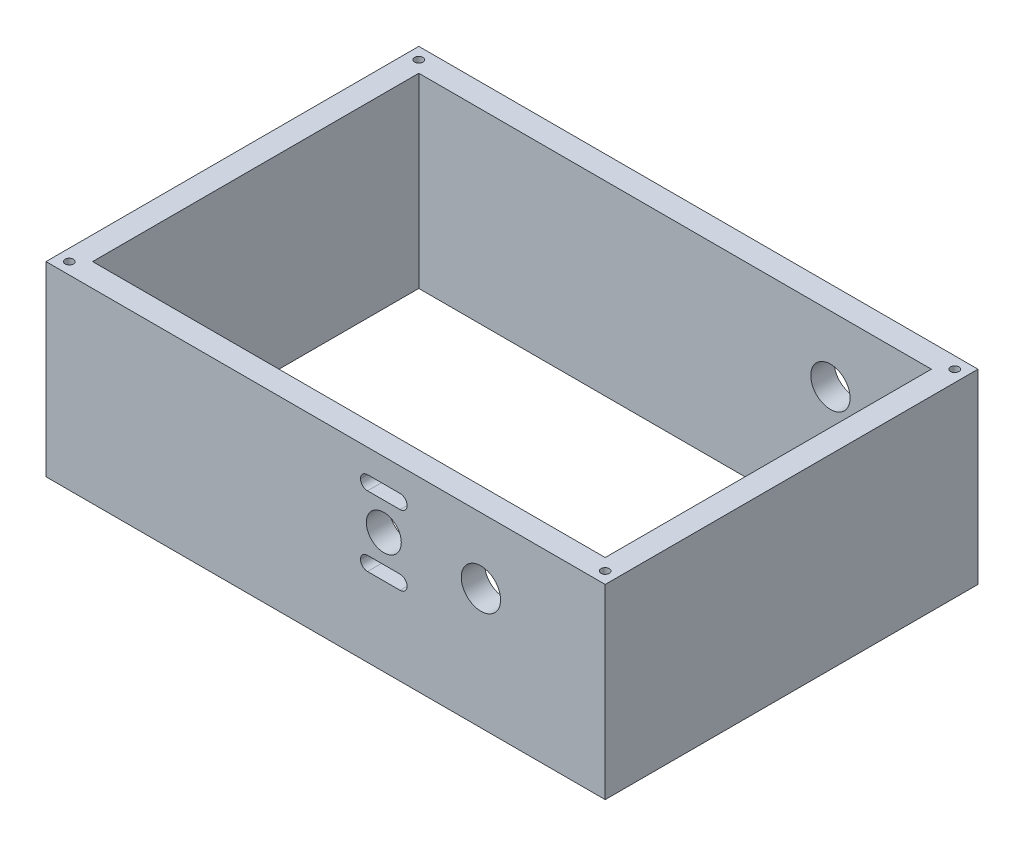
ISO-10303-21;
HEADER;
FILE_DESCRIPTION(('STEP AP214'),'2;1');
FILE_NAME('part.step','',(''),(''),'','','');
FILE_SCHEMA(('AUTOMOTIVE_DESIGN { 1 0 10303 214 1 1 1 1 }'));
ENDSEC;
DATA;
#1=APPLICATION_CONTEXT('core data for automotive mechanical design processes');
#2=APPLICATION_PROTOCOL_DEFINITION('international standard','automotive_design',2000,#1);
#3=PRODUCT_CONTEXT('',#1,'mechanical');
#4=PRODUCT('Part','Part','',(#3));
#5=PRODUCT_RELATED_PRODUCT_CATEGORY('part','',(#4));
#6=PRODUCT_DEFINITION_FORMATION('','',#4);
#7=PRODUCT_DEFINITION_CONTEXT('part definition',#1,'design');
#8=PRODUCT_DEFINITION('design','',#6,#7);
#9=PRODUCT_DEFINITION_SHAPE('','',#8);
#10=(LENGTH_UNIT() NAMED_UNIT(*) SI_UNIT(.MILLI.,.METRE.));
#11=(NAMED_UNIT(*) PLANE_ANGLE_UNIT() SI_UNIT($,.RADIAN.));
#12=(NAMED_UNIT(*) SI_UNIT($,.STERADIAN.) SOLID_ANGLE_UNIT());
#13=UNCERTAINTY_MEASURE_WITH_UNIT(LENGTH_MEASURE(1.E-05),#10,'distance_accuracy_value','');
#14=(GEOMETRIC_REPRESENTATION_CONTEXT(3) GLOBAL_UNCERTAINTY_ASSIGNED_CONTEXT((#13)) GLOBAL_UNIT_ASSIGNED_CONTEXT((#10,
#11,#12)) REPRESENTATION_CONTEXT('',''));
#15=CARTESIAN_POINT('',(0.,0.,0.));
#16=DIRECTION('',(0.,0.,1.));
#17=DIRECTION('',(1.,0.,0.));
#18=AXIS2_PLACEMENT_3D('',#15,#16,#17);
#19=CARTESIAN_POINT('',(76.2,50.8,-50.8));
#20=DIRECTION('',(0.,-1.,0.));
#21=DIRECTION('',(0.,0.,-1.));
#22=AXIS2_PLACEMENT_3D('',#19,#20,#21);
#23=PLANE('',#22);
#24=CARTESIAN_POINT('',(73.025,50.8,47.625));
#25=DIRECTION('',(0.,1.,0.));
#26=DIRECTION('',(0.,0.,1.));
#27=AXIS2_PLACEMENT_3D('',#24,#25,#26);
#28=CIRCLE('',#27,1.1303);
#29=CARTESIAN_POINT('',(73.025,50.8,48.7553));
#30=VERTEX_POINT('',#29);
#31=EDGE_CURVE('E225',#30,#30,#28,.T.);
#32=ORIENTED_EDGE('',*,*,#31,.F.);
#33=EDGE_LOOP('',(#32));
#34=FACE_BOUND('',#33,.T.);
#35=CARTESIAN_POINT('',(73.025,50.8,-47.625));
#36=DIRECTION('',(0.,1.,0.));
#37=DIRECTION('',(0.,0.,1.));
#38=AXIS2_PLACEMENT_3D('',#35,#36,#37);
#39=CIRCLE('',#38,1.1303);
#40=CARTESIAN_POINT('',(73.025,50.8,-46.4947));
#41=VERTEX_POINT('',#40);
#42=EDGE_CURVE('E231',#41,#41,#39,.T.);
#43=ORIENTED_EDGE('',*,*,#42,.F.);
#44=EDGE_LOOP('',(#43));
#45=FACE_BOUND('',#44,.T.);
#46=CARTESIAN_POINT('',(-73.025,50.8,47.625));
#47=DIRECTION('',(0.,1.,0.));
#48=DIRECTION('',(0.,0.,1.));
#49=AXIS2_PLACEMENT_3D('',#46,#47,#48);
#50=CIRCLE('',#49,1.1303);
#51=CARTESIAN_POINT('',(-73.025,50.8,48.7553));
#52=VERTEX_POINT('',#51);
#53=EDGE_CURVE('E237',#52,#52,#50,.T.);
#54=ORIENTED_EDGE('',*,*,#53,.F.);
#55=EDGE_LOOP('',(#54));
#56=FACE_BOUND('',#55,.T.);
#57=CARTESIAN_POINT('',(-73.025,50.8,-47.625));
#58=DIRECTION('',(0.,1.,0.));
#59=DIRECTION('',(0.,0.,1.));
#60=AXIS2_PLACEMENT_3D('',#57,#58,#59);
#61=CIRCLE('',#60,1.1303);
#62=CARTESIAN_POINT('',(-73.025,50.8,-46.4947));
#63=VERTEX_POINT('',#62);
#64=EDGE_CURVE('E249',#63,#63,#61,.T.);
#65=ORIENTED_EDGE('',*,*,#64,.F.);
#66=EDGE_LOOP('',(#65));
#67=FACE_BOUND('',#66,.T.);
#68=DIRECTION('',(0.,0.,-1.));
#69=VECTOR('',#68,1.);
#70=CARTESIAN_POINT('',(76.2,50.8,50.8));
#71=LINE('',#70,#69);
#72=CARTESIAN_POINT('',(76.2,50.8,50.8));
#73=VERTEX_POINT('',#72);
#74=CARTESIAN_POINT('',(76.2,50.8,-50.8));
#75=VERTEX_POINT('',#74);
#76=EDGE_CURVE('E293',#73,#75,#71,.T.);
#77=ORIENTED_EDGE('',*,*,#76,.T.);
#78=DIRECTION('',(-1.,0.,0.));
#79=VECTOR('',#78,1.);
#80=CARTESIAN_POINT('',(-76.2,50.8,-50.8));
#81=LINE('',#80,#79);
#82=CARTESIAN_POINT('',(-76.2,50.8,-50.8));
#83=VERTEX_POINT('',#82);
#84=EDGE_CURVE('E296',#75,#83,#81,.T.);
#85=ORIENTED_EDGE('',*,*,#84,.T.);
#86=DIRECTION('',(0.,0.,1.));
#87=VECTOR('',#86,1.);
#88=CARTESIAN_POINT('',(-76.2,50.8,50.8));
#89=LINE('',#88,#87);
#90=CARTESIAN_POINT('',(-76.2,50.8,50.8));
#91=VERTEX_POINT('',#90);
#92=EDGE_CURVE('E299',#83,#91,#89,.T.);
#93=ORIENTED_EDGE('',*,*,#92,.T.);
#94=DIRECTION('',(1.,0.,0.));
#95=VECTOR('',#94,1.);
#96=CARTESIAN_POINT('',(-76.2,50.8,50.8));
#97=LINE('',#96,#95);
#98=EDGE_CURVE('E301',#91,#73,#97,.T.);
#99=ORIENTED_EDGE('',*,*,#98,.T.);
#100=EDGE_LOOP('',(#77,#85,#93,#99));
#101=FACE_BOUND('',#100,.T.);
#102=DIRECTION('',(0.,0.,1.));
#103=VECTOR('',#102,1.);
#104=CARTESIAN_POINT('',(-69.85,50.8,44.45));
#105=LINE('',#104,#103);
#106=CARTESIAN_POINT('',(-69.85,50.8,-44.45));
#107=VERTEX_POINT('',#106);
#108=CARTESIAN_POINT('',(-69.85,50.8,44.45));
#109=VERTEX_POINT('',#108);
#110=EDGE_CURVE('E262',#107,#109,#105,.T.);
#111=ORIENTED_EDGE('',*,*,#110,.F.);
#112=DIRECTION('',(-1.,0.,0.));
#113=VECTOR('',#112,1.);
#114=CARTESIAN_POINT('',(-69.85,50.8,-44.45));
#115=LINE('',#114,#113);
#116=CARTESIAN_POINT('',(69.8500000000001,50.8,-44.45));
#117=VERTEX_POINT('',#116);
#118=EDGE_CURVE('E270',#117,#107,#115,.T.);
#119=ORIENTED_EDGE('',*,*,#118,.F.);
#120=DIRECTION('',(0.,0.,-1.));
#121=VECTOR('',#120,1.);
#122=CARTESIAN_POINT('',(69.8500000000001,50.8,44.45));
#123=LINE('',#122,#121);
#124=CARTESIAN_POINT('',(69.8500000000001,50.8,44.45));
#125=VERTEX_POINT('',#124);
#126=EDGE_CURVE('E267',#125,#117,#123,.T.);
#127=ORIENTED_EDGE('',*,*,#126,.F.);
#128=DIRECTION('',(1.,0.,0.));
#129=VECTOR('',#128,1.);
#130=CARTESIAN_POINT('',(-69.85,50.8,44.45));
#131=LINE('',#130,#129);
#132=EDGE_CURVE('E264',#109,#125,#131,.T.);
#133=ORIENTED_EDGE('',*,*,#132,.F.);
#134=EDGE_LOOP('',(#111,#119,#127,#133));
#135=FACE_BOUND('',#134,.T.);
#136=ADVANCED_FACE('F36',(#34,#45,#56,#67,#101,#135),#23,.F.);
#137=CARTESIAN_POINT('',(76.2,0.,-50.8));
#138=DIRECTION('',(0.,-1.,0.));
#139=DIRECTION('',(0.,0.,-1.));
#140=AXIS2_PLACEMENT_3D('',#137,#138,#139);
#141=PLANE('',#140);
#142=CARTESIAN_POINT('',(73.025,0.,47.625));
#143=DIRECTION('',(0.,-1.,0.));
#144=DIRECTION('',(0.,0.,-1.));
#145=AXIS2_PLACEMENT_3D('',#142,#143,#144);
#146=CIRCLE('',#145,1.1303);
#147=CARTESIAN_POINT('',(73.025,0.,46.4947));
#148=VERTEX_POINT('',#147);
#149=EDGE_CURVE('E207',#148,#148,#146,.T.);
#150=ORIENTED_EDGE('',*,*,#149,.F.);
#151=EDGE_LOOP('',(#150));
#152=FACE_BOUND('',#151,.T.);
#153=CARTESIAN_POINT('',(73.025,0.,-47.625));
#154=DIRECTION('',(0.,-1.,0.));
#155=DIRECTION('',(0.,0.,-1.));
#156=AXIS2_PLACEMENT_3D('',#153,#154,#155);
#157=CIRCLE('',#156,1.1303);
#158=CARTESIAN_POINT('',(73.025,0.,-48.7553));
#159=VERTEX_POINT('',#158);
#160=EDGE_CURVE('E206',#159,#159,#157,.T.);
#161=ORIENTED_EDGE('',*,*,#160,.F.);
#162=EDGE_LOOP('',(#161));
#163=FACE_BOUND('',#162,.T.);
#164=CARTESIAN_POINT('',(-73.025,0.,47.625));
#165=DIRECTION('',(0.,-1.,0.));
#166=DIRECTION('',(0.,0.,-1.));
#167=AXIS2_PLACEMENT_3D('',#164,#165,#166);
#168=CIRCLE('',#167,1.1303);
#169=CARTESIAN_POINT('',(-73.025,0.,46.4947));
#170=VERTEX_POINT('',#169);
#171=EDGE_CURVE('E219',#170,#170,#168,.T.);
#172=ORIENTED_EDGE('',*,*,#171,.F.);
#173=EDGE_LOOP('',(#172));
#174=FACE_BOUND('',#173,.T.);
#175=CARTESIAN_POINT('',(-73.025,0.,-47.625));
#176=DIRECTION('',(0.,-1.,0.));
#177=DIRECTION('',(0.,0.,-1.));
#178=AXIS2_PLACEMENT_3D('',#175,#176,#177);
#179=CIRCLE('',#178,1.1303);
#180=CARTESIAN_POINT('',(-73.025,0.,-48.7553));
#181=VERTEX_POINT('',#180);
#182=EDGE_CURVE('E243',#181,#181,#179,.T.);
#183=ORIENTED_EDGE('',*,*,#182,.F.);
#184=EDGE_LOOP('',(#183));
#185=FACE_BOUND('',#184,.T.);
#186=DIRECTION('',(0.,0.,-1.));
#187=VECTOR('',#186,1.);
#188=CARTESIAN_POINT('',(76.2,0.,50.8));
#189=LINE('',#188,#187);
#190=CARTESIAN_POINT('',(76.2,0.,50.8));
#191=VERTEX_POINT('',#190);
#192=CARTESIAN_POINT('',(76.2,0.,-50.8));
#193=VERTEX_POINT('',#192);
#194=EDGE_CURVE('E292',#191,#193,#189,.T.);
#195=ORIENTED_EDGE('',*,*,#194,.F.);
#196=DIRECTION('',(1.,0.,0.));
#197=VECTOR('',#196,1.);
#198=CARTESIAN_POINT('',(-76.2,0.,50.8));
#199=LINE('',#198,#197);
#200=CARTESIAN_POINT('',(-76.2,0.,50.8));
#201=VERTEX_POINT('',#200);
#202=EDGE_CURVE('E297',#201,#191,#199,.T.);
#203=ORIENTED_EDGE('',*,*,#202,.F.);
#204=DIRECTION('',(0.,0.,1.));
#205=VECTOR('',#204,1.);
#206=CARTESIAN_POINT('',(-76.2,0.,50.8));
#207=LINE('',#206,#205);
#208=CARTESIAN_POINT('',(-76.2,0.,-50.8));
#209=VERTEX_POINT('',#208);
#210=EDGE_CURVE('E308',#209,#201,#207,.T.);
#211=ORIENTED_EDGE('',*,*,#210,.F.);
#212=DIRECTION('',(-1.,0.,0.));
#213=VECTOR('',#212,1.);
#214=CARTESIAN_POINT('',(-76.2,0.,-50.8));
#215=LINE('',#214,#213);
#216=EDGE_CURVE('E306',#193,#209,#215,.T.);
#217=ORIENTED_EDGE('',*,*,#216,.F.);
#218=EDGE_LOOP('',(#195,#203,#211,#217));
#219=FACE_BOUND('',#218,.T.);
#220=DIRECTION('',(-1.,0.,0.));
#221=VECTOR('',#220,1.);
#222=CARTESIAN_POINT('',(-69.85,0.,-44.45));
#223=LINE('',#222,#221);
#224=CARTESIAN_POINT('',(69.8500000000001,0.,-44.45));
#225=VERTEX_POINT('',#224);
#226=CARTESIAN_POINT('',(-69.85,0.,-44.45));
#227=VERTEX_POINT('',#226);
#228=EDGE_CURVE('E265',#225,#227,#223,.T.);
#229=ORIENTED_EDGE('',*,*,#228,.T.);
#230=DIRECTION('',(0.,0.,1.));
#231=VECTOR('',#230,1.);
#232=CARTESIAN_POINT('',(-69.85,0.,44.45));
#233=LINE('',#232,#231);
#234=CARTESIAN_POINT('',(-69.85,0.,44.45));
#235=VERTEX_POINT('',#234);
#236=EDGE_CURVE('E261',#227,#235,#233,.T.);
#237=ORIENTED_EDGE('',*,*,#236,.T.);
#238=DIRECTION('',(1.,0.,0.));
#239=VECTOR('',#238,1.);
#240=CARTESIAN_POINT('',(-69.85,0.,44.45));
#241=LINE('',#240,#239);
#242=CARTESIAN_POINT('',(69.8500000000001,0.,44.45));
#243=VERTEX_POINT('',#242);
#244=EDGE_CURVE('E275',#235,#243,#241,.T.);
#245=ORIENTED_EDGE('',*,*,#244,.T.);
#246=DIRECTION('',(0.,0.,-1.));
#247=VECTOR('',#246,1.);
#248=CARTESIAN_POINT('',(69.8500000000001,0.,44.45));
#249=LINE('',#248,#247);
#250=EDGE_CURVE('E278',#243,#225,#249,.T.);
#251=ORIENTED_EDGE('',*,*,#250,.T.);
#252=EDGE_LOOP('',(#229,#237,#245,#251));
#253=FACE_BOUND('',#252,.T.);
#254=ADVANCED_FACE('F456',(#152,#163,#174,#185,#219,#253),#141,.T.);
#255=CARTESIAN_POINT('',(76.2,50.8,50.8));
#256=DIRECTION('',(-1.,0.,0.));
#257=DIRECTION('',(0.,0.,1.));
#258=AXIS2_PLACEMENT_3D('',#255,#256,#257);
#259=PLANE('',#258);
#260=ORIENTED_EDGE('',*,*,#194,.T.);
#261=DIRECTION('',(0.,-1.,0.));
#262=VECTOR('',#261,1.);
#263=CARTESIAN_POINT('',(76.2,50.8,-50.8));
#264=LINE('',#263,#262);
#265=EDGE_CURVE('E319',#75,#193,#264,.T.);
#266=ORIENTED_EDGE('',*,*,#265,.F.);
#267=ORIENTED_EDGE('',*,*,#76,.F.);
#268=DIRECTION('',(0.,-1.,0.));
#269=VECTOR('',#268,1.);
#270=CARTESIAN_POINT('',(76.2,50.8,50.8));
#271=LINE('',#270,#269);
#272=EDGE_CURVE('E303',#73,#191,#271,.T.);
#273=ORIENTED_EDGE('',*,*,#272,.T.);
#274=EDGE_LOOP('',(#260,#266,#267,#273));
#275=FACE_BOUND('',#274,.T.);
#276=ADVANCED_FACE('F462',(#275),#259,.F.);
#277=CARTESIAN_POINT('',(-76.2,50.8,-50.8));
#278=DIRECTION('',(0.,0.,1.));
#279=DIRECTION('',(1.,0.,0.));
#280=AXIS2_PLACEMENT_3D('',#277,#278,#279);
#281=PLANE('',#280);
#282=CARTESIAN_POINT('',(42.3291,32.893,-50.8));
#283=DIRECTION('',(0.,0.,1.));
#284=DIRECTION('',(1.,0.,0.));
#285=AXIS2_PLACEMENT_3D('',#282,#283,#284);
#286=CIRCLE('',#285,5.35812999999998);
#287=CARTESIAN_POINT('',(47.68723,32.893,-50.8));
#288=VERTEX_POINT('',#287);
#289=EDGE_CURVE('E391',#288,#288,#286,.T.);
#290=ORIENTED_EDGE('',*,*,#289,.T.);
#291=EDGE_LOOP('',(#290));
#292=FACE_BOUND('',#291,.T.);
#293=ORIENTED_EDGE('',*,*,#216,.T.);
#294=DIRECTION('',(0.,-1.,0.));
#295=VECTOR('',#294,1.);
#296=CARTESIAN_POINT('',(-76.2,50.8,-50.8));
#297=LINE('',#296,#295);
#298=EDGE_CURVE('E316',#83,#209,#297,.T.);
#299=ORIENTED_EDGE('',*,*,#298,.F.);
#300=ORIENTED_EDGE('',*,*,#84,.F.);
#301=ORIENTED_EDGE('',*,*,#265,.T.);
#302=EDGE_LOOP('',(#293,#299,#300,#301));
#303=FACE_BOUND('',#302,.T.);
#304=ADVANCED_FACE('F477',(#292,#303),#281,.F.);
#305=CARTESIAN_POINT('',(-76.2,50.8,50.8));
#306=DIRECTION('',(1.,0.,0.));
#307=DIRECTION('',(0.,0.,-1.));
#308=AXIS2_PLACEMENT_3D('',#305,#306,#307);
#309=PLANE('',#308);
#310=ORIENTED_EDGE('',*,*,#210,.T.);
#311=DIRECTION('',(0.,-1.,0.));
#312=VECTOR('',#311,1.);
#313=CARTESIAN_POINT('',(-76.2,50.8,50.8));
#314=LINE('',#313,#312);
#315=EDGE_CURVE('E313',#91,#201,#314,.T.);
#316=ORIENTED_EDGE('',*,*,#315,.F.);
#317=ORIENTED_EDGE('',*,*,#92,.F.);
#318=ORIENTED_EDGE('',*,*,#298,.T.);
#319=EDGE_LOOP('',(#310,#316,#317,#318));
#320=FACE_BOUND('',#319,.T.);
#321=ADVANCED_FACE('F473',(#320),#309,.F.);
#322=CARTESIAN_POINT('',(-76.2,50.8,50.8));
#323=DIRECTION('',(0.,0.,-1.));
#324=DIRECTION('',(-1.,0.,0.));
#325=AXIS2_PLACEMENT_3D('',#322,#323,#324);
#326=PLANE('',#325);
#327=CARTESIAN_POINT('',(42.3291,32.893,50.8));
#328=DIRECTION('',(0.,0.,1.));
#329=DIRECTION('',(1.,0.,0.));
#330=AXIS2_PLACEMENT_3D('',#327,#328,#329);
#331=CIRCLE('',#330,5.35812999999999);
#332=CARTESIAN_POINT('',(47.68723,32.893,50.8));
#333=VERTEX_POINT('',#332);
#334=EDGE_CURVE('E613',#333,#333,#331,.T.);
#335=ORIENTED_EDGE('',*,*,#334,.F.);
#336=EDGE_LOOP('',(#335));
#337=FACE_BOUND('',#336,.T.);
#338=DIRECTION('',(-1.,0.,0.));
#339=VECTOR('',#338,1.);
#340=CARTESIAN_POINT('',(22.2097600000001,25.273,50.8));
#341=LINE('',#340,#339);
#342=CARTESIAN_POINT('',(20.3047600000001,25.273,50.8));
#343=VERTEX_POINT('',#342);
#344=CARTESIAN_POINT('',(11.4147600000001,25.273,50.8));
#345=VERTEX_POINT('',#344);
#346=EDGE_CURVE('E395',#343,#345,#341,.T.);
#347=ORIENTED_EDGE('',*,*,#346,.F.);
#348=CARTESIAN_POINT('',(20.3047600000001,23.368,50.8));
#349=DIRECTION('',(0.,0.,-1.));
#350=DIRECTION('',(-1.,0.,0.));
#351=AXIS2_PLACEMENT_3D('',#348,#349,#350);
#352=CIRCLE('',#351,1.905);
#353=CARTESIAN_POINT('',(22.2097600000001,23.368,50.8));
#354=VERTEX_POINT('',#353);
#355=EDGE_CURVE('E370',#343,#354,#352,.T.);
#356=ORIENTED_EDGE('',*,*,#355,.T.);
#357=CARTESIAN_POINT('',(20.3047600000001,23.368,50.8));
#358=DIRECTION('',(0.,0.,-1.));
#359=DIRECTION('',(-1.,0.,0.));
#360=AXIS2_PLACEMENT_3D('',#357,#358,#359);
#361=CIRCLE('',#360,1.905);
#362=CARTESIAN_POINT('',(20.3047600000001,21.463,50.8));
#363=VERTEX_POINT('',#362);
#364=EDGE_CURVE('E366',#354,#363,#361,.T.);
#365=ORIENTED_EDGE('',*,*,#364,.T.);
#366=DIRECTION('',(1.,0.,0.));
#367=VECTOR('',#366,1.);
#368=CARTESIAN_POINT('',(22.2097600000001,21.463,50.8));
#369=LINE('',#368,#367);
#370=CARTESIAN_POINT('',(11.4147600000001,21.463,50.8));
#371=VERTEX_POINT('',#370);
#372=EDGE_CURVE('E380',#371,#363,#369,.T.);
#373=ORIENTED_EDGE('',*,*,#372,.F.);
#374=CARTESIAN_POINT('',(11.4147600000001,23.368,50.8));
#375=DIRECTION('',(0.,0.,-1.));
#376=DIRECTION('',(-1.,0.,0.));
#377=AXIS2_PLACEMENT_3D('',#374,#375,#376);
#378=CIRCLE('',#377,1.905);
#379=CARTESIAN_POINT('',(9.50976000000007,23.368,50.8));
#380=VERTEX_POINT('',#379);
#381=EDGE_CURVE('E45',#371,#380,#378,.T.);
#382=ORIENTED_EDGE('',*,*,#381,.T.);
#383=CARTESIAN_POINT('',(11.4147600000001,23.368,50.8));
#384=DIRECTION('',(0.,0.,-1.));
#385=DIRECTION('',(-1.,0.,0.));
#386=AXIS2_PLACEMENT_3D('',#383,#384,#385);
#387=CIRCLE('',#386,1.905);
#388=EDGE_CURVE('E374',#380,#345,#387,.T.);
#389=ORIENTED_EDGE('',*,*,#388,.T.);
#390=EDGE_LOOP('',(#347,#356,#365,#373,#382,#389));
#391=FACE_BOUND('',#390,.T.);
#392=DIRECTION('',(-1.,0.,0.));
#393=VECTOR('',#392,1.);
#394=CARTESIAN_POINT('',(22.2097600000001,44.323,50.8));
#395=LINE('',#394,#393);
#396=CARTESIAN_POINT('',(20.3047600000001,44.323,50.8));
#397=VERTEX_POINT('',#396);
#398=CARTESIAN_POINT('',(11.4147600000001,44.323,50.8));
#399=VERTEX_POINT('',#398);
#400=EDGE_CURVE('E404',#397,#399,#395,.T.);
#401=ORIENTED_EDGE('',*,*,#400,.F.);
#402=CARTESIAN_POINT('',(20.3047600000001,42.418,50.8));
#403=DIRECTION('',(0.,0.,-1.));
#404=DIRECTION('',(-1.,0.,0.));
#405=AXIS2_PLACEMENT_3D('',#402,#403,#404);
#406=CIRCLE('',#405,1.905);
#407=CARTESIAN_POINT('',(22.2097600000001,42.418,50.8));
#408=VERTEX_POINT('',#407);
#409=EDGE_CURVE('E336',#397,#408,#406,.T.);
#410=ORIENTED_EDGE('',*,*,#409,.T.);
#411=CARTESIAN_POINT('',(20.3047600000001,42.418,50.8));
#412=DIRECTION('',(0.,0.,-1.));
#413=DIRECTION('',(-1.,0.,0.));
#414=AXIS2_PLACEMENT_3D('',#411,#412,#413);
#415=CIRCLE('',#414,1.905);
#416=CARTESIAN_POINT('',(20.3047600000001,40.513,50.8));
#417=VERTEX_POINT('',#416);
#418=EDGE_CURVE('E332',#408,#417,#415,.T.);
#419=ORIENTED_EDGE('',*,*,#418,.T.);
#420=DIRECTION('',(1.,0.,0.));
#421=VECTOR('',#420,1.);
#422=CARTESIAN_POINT('',(22.2097600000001,40.513,50.8));
#423=LINE('',#422,#421);
#424=CARTESIAN_POINT('',(11.4147600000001,40.513,50.8));
#425=VERTEX_POINT('',#424);
#426=EDGE_CURVE('E352',#425,#417,#423,.T.);
#427=ORIENTED_EDGE('',*,*,#426,.F.);
#428=CARTESIAN_POINT('',(11.4147600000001,42.418,50.8));
#429=DIRECTION('',(0.,0.,-1.));
#430=DIRECTION('',(-1.,0.,0.));
#431=AXIS2_PLACEMENT_3D('',#428,#429,#430);
#432=CIRCLE('',#431,1.905);
#433=CARTESIAN_POINT('',(9.50976000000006,42.418,50.8));
#434=VERTEX_POINT('',#433);
#435=EDGE_CURVE('E344',#425,#434,#432,.T.);
#436=ORIENTED_EDGE('',*,*,#435,.T.);
#437=CARTESIAN_POINT('',(11.4147600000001,42.418,50.8));
#438=DIRECTION('',(0.,0.,-1.));
#439=DIRECTION('',(-1.,0.,0.));
#440=AXIS2_PLACEMENT_3D('',#437,#438,#439);
#441=CIRCLE('',#440,1.905);
#442=EDGE_CURVE('E340',#434,#399,#441,.T.);
#443=ORIENTED_EDGE('',*,*,#442,.T.);
#444=EDGE_LOOP('',(#401,#410,#419,#427,#436,#443));
#445=FACE_BOUND('',#444,.T.);
#446=CARTESIAN_POINT('',(15.8623000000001,32.893,50.8));
#447=DIRECTION('',(0.,0.,1.));
#448=DIRECTION('',(1.,0.,0.));
#449=AXIS2_PLACEMENT_3D('',#446,#447,#448);
#450=CIRCLE('',#449,4.7625);
#451=CARTESIAN_POINT('',(20.6248000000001,32.893,50.8));
#452=VERTEX_POINT('',#451);
#453=EDGE_CURVE('E255',#452,#452,#450,.T.);
#454=ORIENTED_EDGE('',*,*,#453,.F.);
#455=EDGE_LOOP('',(#454));
#456=FACE_BOUND('',#455,.T.);
#457=ORIENTED_EDGE('',*,*,#202,.T.);
#458=ORIENTED_EDGE('',*,*,#272,.F.);
#459=ORIENTED_EDGE('',*,*,#98,.F.);
#460=ORIENTED_EDGE('',*,*,#315,.T.);
#461=EDGE_LOOP('',(#457,#458,#459,#460));
#462=FACE_BOUND('',#461,.T.);
#463=ADVANCED_FACE('F429',(#337,#391,#445,#456,#462),#326,.F.);
#464=CARTESIAN_POINT('',(-69.85,50.8,44.45));
#465=DIRECTION('',(1.,0.,0.));
#466=DIRECTION('',(0.,0.,-1.));
#467=AXIS2_PLACEMENT_3D('',#464,#465,#466);
#468=PLANE('',#467);
#469=ORIENTED_EDGE('',*,*,#236,.F.);
#470=DIRECTION('',(0.,-1.,0.));
#471=VECTOR('',#470,1.);
#472=CARTESIAN_POINT('',(-69.85,50.8,-44.45));
#473=LINE('',#472,#471);
#474=EDGE_CURVE('E272',#107,#227,#473,.T.);
#475=ORIENTED_EDGE('',*,*,#474,.F.);
#476=ORIENTED_EDGE('',*,*,#110,.T.);
#477=DIRECTION('',(0.,-1.,0.));
#478=VECTOR('',#477,1.);
#479=CARTESIAN_POINT('',(-69.85,50.8,44.45));
#480=LINE('',#479,#478);
#481=EDGE_CURVE('E289',#109,#235,#480,.T.);
#482=ORIENTED_EDGE('',*,*,#481,.T.);
#483=EDGE_LOOP('',(#469,#475,#476,#482));
#484=FACE_BOUND('',#483,.T.);
#485=ADVANCED_FACE('F468',(#484),#468,.T.);
#486=CARTESIAN_POINT('',(-69.85,50.8,44.45));
#487=DIRECTION('',(0.,0.,-1.));
#488=DIRECTION('',(-1.,0.,0.));
#489=AXIS2_PLACEMENT_3D('',#486,#487,#488);
#490=PLANE('',#489);
#491=CARTESIAN_POINT('',(42.3291,32.893,44.45));
#492=DIRECTION('',(0.,0.,-1.));
#493=DIRECTION('',(-1.,0.,0.));
#494=AXIS2_PLACEMENT_3D('',#491,#492,#493);
#495=CIRCLE('',#494,5.35812999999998);
#496=CARTESIAN_POINT('',(36.9709700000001,32.893,44.45));
#497=VERTEX_POINT('',#496);
#498=EDGE_CURVE('E40',#497,#497,#495,.T.);
#499=ORIENTED_EDGE('',*,*,#498,.F.);
#500=EDGE_LOOP('',(#499));
#501=FACE_BOUND('',#500,.T.);
#502=CARTESIAN_POINT('',(11.4147600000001,23.368,44.45));
#503=DIRECTION('',(0.,0.,-1.));
#504=DIRECTION('',(-1.,0.,0.));
#505=AXIS2_PLACEMENT_3D('',#502,#503,#504);
#506=CIRCLE('',#505,1.905);
#507=CARTESIAN_POINT('',(11.4147600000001,25.273,44.45));
#508=VERTEX_POINT('',#507);
#509=CARTESIAN_POINT('',(9.50976000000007,23.368,44.45));
#510=VERTEX_POINT('',#509);
#511=EDGE_CURVE('E52',#508,#510,#506,.F.);
#512=ORIENTED_EDGE('',*,*,#511,.T.);
#513=CARTESIAN_POINT('',(11.4147600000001,23.368,44.45));
#514=DIRECTION('',(0.,0.,-1.));
#515=DIRECTION('',(-1.,0.,0.));
#516=AXIS2_PLACEMENT_3D('',#513,#514,#515);
#517=CIRCLE('',#516,1.905);
#518=CARTESIAN_POINT('',(11.4147600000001,21.463,44.45));
#519=VERTEX_POINT('',#518);
#520=EDGE_CURVE('E11',#510,#519,#517,.F.);
#521=ORIENTED_EDGE('',*,*,#520,.T.);
#522=DIRECTION('',(1.,0.,0.));
#523=VECTOR('',#522,1.);
#524=CARTESIAN_POINT('',(22.2097600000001,21.463,44.45));
#525=LINE('',#524,#523);
#526=CARTESIAN_POINT('',(20.3047600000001,21.463,44.45));
#527=VERTEX_POINT('',#526);
#528=EDGE_CURVE('E398',#519,#527,#525,.T.);
#529=ORIENTED_EDGE('',*,*,#528,.T.);
#530=CARTESIAN_POINT('',(20.3047600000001,23.368,44.45));
#531=DIRECTION('',(0.,0.,-1.));
#532=DIRECTION('',(-1.,0.,0.));
#533=AXIS2_PLACEMENT_3D('',#530,#531,#532);
#534=CIRCLE('',#533,1.905);
#535=CARTESIAN_POINT('',(22.2097600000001,23.368,44.45));
#536=VERTEX_POINT('',#535);
#537=EDGE_CURVE('E368',#527,#536,#534,.F.);
#538=ORIENTED_EDGE('',*,*,#537,.T.);
#539=CARTESIAN_POINT('',(20.3047600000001,23.368,44.45));
#540=DIRECTION('',(0.,0.,-1.));
#541=DIRECTION('',(-1.,0.,0.));
#542=AXIS2_PLACEMENT_3D('',#539,#540,#541);
#543=CIRCLE('',#542,1.905);
#544=CARTESIAN_POINT('',(20.3047600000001,25.273,44.45));
#545=VERTEX_POINT('',#544);
#546=EDGE_CURVE('E372',#536,#545,#543,.F.);
#547=ORIENTED_EDGE('',*,*,#546,.T.);
#548=DIRECTION('',(-1.,0.,0.));
#549=VECTOR('',#548,1.);
#550=CARTESIAN_POINT('',(22.2097600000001,25.273,44.45));
#551=LINE('',#550,#549);
#552=EDGE_CURVE('E356',#545,#508,#551,.T.);
#553=ORIENTED_EDGE('',*,*,#552,.T.);
#554=EDGE_LOOP('',(#512,#521,#529,#538,#547,#553));
#555=FACE_BOUND('',#554,.T.);
#556=CARTESIAN_POINT('',(11.4147600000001,42.418,44.45));
#557=DIRECTION('',(0.,0.,-1.));
#558=DIRECTION('',(-1.,0.,0.));
#559=AXIS2_PLACEMENT_3D('',#556,#557,#558);
#560=CIRCLE('',#559,1.905);
#561=CARTESIAN_POINT('',(11.4147600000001,44.323,44.45));
#562=VERTEX_POINT('',#561);
#563=CARTESIAN_POINT('',(9.50976000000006,42.418,44.45));
#564=VERTEX_POINT('',#563);
#565=EDGE_CURVE('E342',#562,#564,#560,.F.);
#566=ORIENTED_EDGE('',*,*,#565,.T.);
#567=CARTESIAN_POINT('',(11.4147600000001,42.418,44.45));
#568=DIRECTION('',(0.,0.,-1.));
#569=DIRECTION('',(-1.,0.,0.));
#570=AXIS2_PLACEMENT_3D('',#567,#568,#569);
#571=CIRCLE('',#570,1.905);
#572=CARTESIAN_POINT('',(11.4147600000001,40.513,44.45));
#573=VERTEX_POINT('',#572);
#574=EDGE_CURVE('E346',#564,#573,#571,.F.);
#575=ORIENTED_EDGE('',*,*,#574,.T.);
#576=DIRECTION('',(1.,0.,0.));
#577=VECTOR('',#576,1.);
#578=CARTESIAN_POINT('',(22.2097600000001,40.513,44.45));
#579=LINE('',#578,#577);
#580=CARTESIAN_POINT('',(20.3047600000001,40.513,44.45));
#581=VERTEX_POINT('',#580);
#582=EDGE_CURVE('E407',#573,#581,#579,.T.);
#583=ORIENTED_EDGE('',*,*,#582,.T.);
#584=CARTESIAN_POINT('',(20.3047600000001,42.418,44.45));
#585=DIRECTION('',(0.,0.,-1.));
#586=DIRECTION('',(-1.,0.,0.));
#587=AXIS2_PLACEMENT_3D('',#584,#585,#586);
#588=CIRCLE('',#587,1.905);
#589=CARTESIAN_POINT('',(22.2097600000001,42.418,44.45));
#590=VERTEX_POINT('',#589);
#591=EDGE_CURVE('E334',#581,#590,#588,.F.);
#592=ORIENTED_EDGE('',*,*,#591,.T.);
#593=CARTESIAN_POINT('',(20.3047600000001,42.418,44.45));
#594=DIRECTION('',(0.,0.,-1.));
#595=DIRECTION('',(-1.,0.,0.));
#596=AXIS2_PLACEMENT_3D('',#593,#594,#595);
#597=CIRCLE('',#596,1.905);
#598=CARTESIAN_POINT('',(20.3047600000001,44.323,44.45));
#599=VERTEX_POINT('',#598);
#600=EDGE_CURVE('E338',#590,#599,#597,.F.);
#601=ORIENTED_EDGE('',*,*,#600,.T.);
#602=DIRECTION('',(-1.,0.,0.));
#603=VECTOR('',#602,1.);
#604=CARTESIAN_POINT('',(22.2097600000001,44.323,44.45));
#605=LINE('',#604,#603);
#606=EDGE_CURVE('E213',#599,#562,#605,.T.);
#607=ORIENTED_EDGE('',*,*,#606,.T.);
#608=EDGE_LOOP('',(#566,#575,#583,#592,#601,#607));
#609=FACE_BOUND('',#608,.T.);
#610=CARTESIAN_POINT('',(15.8623000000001,32.893,44.45));
#611=DIRECTION('',(0.,0.,-1.));
#612=DIRECTION('',(-1.,0.,0.));
#613=AXIS2_PLACEMENT_3D('',#610,#611,#612);
#614=CIRCLE('',#613,4.7625);
#615=CARTESIAN_POINT('',(11.0998,32.893,44.45));
#616=VERTEX_POINT('',#615);
#617=EDGE_CURVE('E258',#616,#616,#614,.F.);
#618=ORIENTED_EDGE('',*,*,#617,.T.);
#619=EDGE_LOOP('',(#618));
#620=FACE_BOUND('',#619,.T.);
#621=ORIENTED_EDGE('',*,*,#244,.F.);
#622=ORIENTED_EDGE('',*,*,#481,.F.);
#623=ORIENTED_EDGE('',*,*,#132,.T.);
#624=DIRECTION('',(0.,-1.,0.));
#625=VECTOR('',#624,1.);
#626=CARTESIAN_POINT('',(69.8500000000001,50.8,44.45));
#627=LINE('',#626,#625);
#628=EDGE_CURVE('E287',#125,#243,#627,.T.);
#629=ORIENTED_EDGE('',*,*,#628,.T.);
#630=EDGE_LOOP('',(#621,#622,#623,#629));
#631=FACE_BOUND('',#630,.T.);
#632=ADVANCED_FACE('F414',(#501,#555,#609,#620,#631),#490,.T.);
#633=CARTESIAN_POINT('',(69.8500000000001,50.8,44.45));
#634=DIRECTION('',(-1.,0.,0.));
#635=DIRECTION('',(0.,0.,1.));
#636=AXIS2_PLACEMENT_3D('',#633,#634,#635);
#637=PLANE('',#636);
#638=ORIENTED_EDGE('',*,*,#250,.F.);
#639=ORIENTED_EDGE('',*,*,#628,.F.);
#640=ORIENTED_EDGE('',*,*,#126,.T.);
#641=DIRECTION('',(0.,-1.,0.));
#642=VECTOR('',#641,1.);
#643=CARTESIAN_POINT('',(69.8500000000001,50.8,-44.45));
#644=LINE('',#643,#642);
#645=EDGE_CURVE('E285',#117,#225,#644,.T.);
#646=ORIENTED_EDGE('',*,*,#645,.T.);
#647=EDGE_LOOP('',(#638,#639,#640,#646));
#648=FACE_BOUND('',#647,.T.);
#649=ADVANCED_FACE('F515',(#648),#637,.T.);
#650=CARTESIAN_POINT('',(-69.85,50.8,-44.45));
#651=DIRECTION('',(0.,0.,1.));
#652=DIRECTION('',(1.,0.,0.));
#653=AXIS2_PLACEMENT_3D('',#650,#651,#652);
#654=PLANE('',#653);
#655=CARTESIAN_POINT('',(42.3291,32.893,-44.45));
#656=DIRECTION('',(0.,0.,1.));
#657=DIRECTION('',(1.,0.,0.));
#658=AXIS2_PLACEMENT_3D('',#655,#656,#657);
#659=CIRCLE('',#658,5.35812999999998);
#660=CARTESIAN_POINT('',(47.68723,32.893,-44.45));
#661=VERTEX_POINT('',#660);
#662=EDGE_CURVE('E383',#661,#661,#659,.T.);
#663=ORIENTED_EDGE('',*,*,#662,.F.);
#664=EDGE_LOOP('',(#663));
#665=FACE_BOUND('',#664,.T.);
#666=ORIENTED_EDGE('',*,*,#228,.F.);
#667=ORIENTED_EDGE('',*,*,#645,.F.);
#668=ORIENTED_EDGE('',*,*,#118,.T.);
#669=ORIENTED_EDGE('',*,*,#474,.T.);
#670=EDGE_LOOP('',(#666,#667,#668,#669));
#671=FACE_BOUND('',#670,.T.);
#672=ADVANCED_FACE('F513',(#665,#671),#654,.T.);
#673=CARTESIAN_POINT('',(15.8623000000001,32.893,30.9796158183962));
#674=DIRECTION('',(0.,0.,1.));
#675=DIRECTION('',(1.,0.,0.));
#676=AXIS2_PLACEMENT_3D('',#673,#674,#675);
#677=CYLINDRICAL_SURFACE('',#676,4.7625);
#678=ORIENTED_EDGE('',*,*,#453,.T.);
#679=EDGE_LOOP('',(#678));
#680=FACE_BOUND('',#679,.T.);
#681=ORIENTED_EDGE('',*,*,#617,.F.);
#682=EDGE_LOOP('',(#681));
#683=FACE_BOUND('',#682,.T.);
#684=ADVANCED_FACE('F522',(#680,#683),#677,.F.);
#685=CARTESIAN_POINT('',(-73.025,31.75,-47.625));
#686=DIRECTION('',(0.,1.,0.));
#687=DIRECTION('',(0.,0.,1.));
#688=AXIS2_PLACEMENT_3D('',#685,#686,#687);
#689=CONICAL_SURFACE('',#688,1.1303,1.02974425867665);
#690=CARTESIAN_POINT('',(-73.025,31.0708472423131,-47.625));
#691=VERTEX_POINT('',#690);
#692=VERTEX_LOOP('',#691);
#693=FACE_BOUND('',#692,.T.);
#694=CARTESIAN_POINT('',(-73.025,31.75,-47.625));
#695=DIRECTION('',(0.,1.,0.));
#696=DIRECTION('',(0.,0.,1.));
#697=AXIS2_PLACEMENT_3D('',#694,#695,#696);
#698=CIRCLE('',#697,1.1303);
#699=CARTESIAN_POINT('',(-73.025,31.75,-46.4947));
#700=VERTEX_POINT('',#699);
#701=EDGE_CURVE('E252',#700,#700,#698,.T.);
#702=ORIENTED_EDGE('',*,*,#701,.T.);
#703=EDGE_LOOP('',(#702));
#704=FACE_BOUND('',#703,.T.);
#705=ADVANCED_FACE('F529',(#693,#704),#689,.F.);
#706=CARTESIAN_POINT('',(-73.025,50.8,-47.625));
#707=DIRECTION('',(0.,1.,0.));
#708=DIRECTION('',(0.,0.,1.));
#709=AXIS2_PLACEMENT_3D('',#706,#707,#708);
#710=CYLINDRICAL_SURFACE('',#709,1.1303);
#711=ORIENTED_EDGE('',*,*,#701,.F.);
#712=EDGE_LOOP('',(#711));
#713=FACE_BOUND('',#712,.T.);
#714=ORIENTED_EDGE('',*,*,#64,.T.);
#715=EDGE_LOOP('',(#714));
#716=FACE_BOUND('',#715,.T.);
#717=ADVANCED_FACE('F533',(#713,#716),#710,.F.);
#718=CARTESIAN_POINT('',(-73.025,19.05,-47.625));
#719=DIRECTION('',(0.,-1.,0.));
#720=DIRECTION('',(0.,0.,-1.));
#721=AXIS2_PLACEMENT_3D('',#718,#719,#720);
#722=CONICAL_SURFACE('',#721,1.1303,1.02974425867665);
#723=CARTESIAN_POINT('',(-73.025,19.7291527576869,-47.625));
#724=VERTEX_POINT('',#723);
#725=VERTEX_LOOP('',#724);
#726=FACE_BOUND('',#725,.T.);
#727=CARTESIAN_POINT('',(-73.025,19.05,-47.625));
#728=DIRECTION('',(0.,-1.,0.));
#729=DIRECTION('',(0.,0.,-1.));
#730=AXIS2_PLACEMENT_3D('',#727,#728,#729);
#731=CIRCLE('',#730,1.1303);
#732=CARTESIAN_POINT('',(-73.025,19.05,-48.7553));
#733=VERTEX_POINT('',#732);
#734=EDGE_CURVE('E246',#733,#733,#731,.T.);
#735=ORIENTED_EDGE('',*,*,#734,.T.);
#736=EDGE_LOOP('',(#735));
#737=FACE_BOUND('',#736,.T.);
#738=ADVANCED_FACE('F537',(#726,#737),#722,.F.);
#739=CARTESIAN_POINT('',(-73.025,0.,-47.625));
#740=DIRECTION('',(0.,-1.,0.));
#741=DIRECTION('',(0.,0.,-1.));
#742=AXIS2_PLACEMENT_3D('',#739,#740,#741);
#743=CYLINDRICAL_SURFACE('',#742,1.1303);
#744=ORIENTED_EDGE('',*,*,#734,.F.);
#745=EDGE_LOOP('',(#744));
#746=FACE_BOUND('',#745,.T.);
#747=ORIENTED_EDGE('',*,*,#182,.T.);
#748=EDGE_LOOP('',(#747));
#749=FACE_BOUND('',#748,.T.);
#750=ADVANCED_FACE('F541',(#746,#749),#743,.F.);
#751=CARTESIAN_POINT('',(-73.025,31.75,47.625));
#752=DIRECTION('',(0.,1.,0.));
#753=DIRECTION('',(0.,0.,1.));
#754=AXIS2_PLACEMENT_3D('',#751,#752,#753);
#755=CONICAL_SURFACE('',#754,1.1303,1.02974425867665);
#756=CARTESIAN_POINT('',(-73.025,31.0708472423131,47.625));
#757=VERTEX_POINT('',#756);
#758=VERTEX_LOOP('',#757);
#759=FACE_BOUND('',#758,.T.);
#760=CARTESIAN_POINT('',(-73.025,31.75,47.625));
#761=DIRECTION('',(0.,1.,0.));
#762=DIRECTION('',(0.,0.,1.));
#763=AXIS2_PLACEMENT_3D('',#760,#761,#762);
#764=CIRCLE('',#763,1.1303);
#765=CARTESIAN_POINT('',(-73.025,31.75,48.7553));
#766=VERTEX_POINT('',#765);
#767=EDGE_CURVE('E240',#766,#766,#764,.T.);
#768=ORIENTED_EDGE('',*,*,#767,.T.);
#769=EDGE_LOOP('',(#768));
#770=FACE_BOUND('',#769,.T.);
#771=ADVANCED_FACE('F545',(#759,#770),#755,.F.);
#772=CARTESIAN_POINT('',(-73.025,50.8,47.625));
#773=DIRECTION('',(0.,1.,0.));
#774=DIRECTION('',(0.,0.,1.));
#775=AXIS2_PLACEMENT_3D('',#772,#773,#774);
#776=CYLINDRICAL_SURFACE('',#775,1.1303);
#777=ORIENTED_EDGE('',*,*,#767,.F.);
#778=EDGE_LOOP('',(#777));
#779=FACE_BOUND('',#778,.T.);
#780=ORIENTED_EDGE('',*,*,#53,.T.);
#781=EDGE_LOOP('',(#780));
#782=FACE_BOUND('',#781,.T.);
#783=ADVANCED_FACE('F549',(#779,#782),#776,.F.);
#784=CARTESIAN_POINT('',(73.025,31.75,-47.625));
#785=DIRECTION('',(0.,1.,0.));
#786=DIRECTION('',(0.,0.,1.));
#787=AXIS2_PLACEMENT_3D('',#784,#785,#786);
#788=CONICAL_SURFACE('',#787,1.1303,1.02974425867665);
#789=CARTESIAN_POINT('',(73.025,31.0708472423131,-47.625));
#790=VERTEX_POINT('',#789);
#791=VERTEX_LOOP('',#790);
#792=FACE_BOUND('',#791,.T.);
#793=CARTESIAN_POINT('',(73.025,31.75,-47.625));
#794=DIRECTION('',(0.,1.,0.));
#795=DIRECTION('',(0.,0.,1.));
#796=AXIS2_PLACEMENT_3D('',#793,#794,#795);
#797=CIRCLE('',#796,1.1303);
#798=CARTESIAN_POINT('',(73.025,31.75,-46.4947));
#799=VERTEX_POINT('',#798);
#800=EDGE_CURVE('E234',#799,#799,#797,.T.);
#801=ORIENTED_EDGE('',*,*,#800,.T.);
#802=EDGE_LOOP('',(#801));
#803=FACE_BOUND('',#802,.T.);
#804=ADVANCED_FACE('F553',(#792,#803),#788,.F.);
#805=CARTESIAN_POINT('',(73.025,50.8,-47.625));
#806=DIRECTION('',(0.,1.,0.));
#807=DIRECTION('',(0.,0.,1.));
#808=AXIS2_PLACEMENT_3D('',#805,#806,#807);
#809=CYLINDRICAL_SURFACE('',#808,1.1303);
#810=ORIENTED_EDGE('',*,*,#800,.F.);
#811=EDGE_LOOP('',(#810));
#812=FACE_BOUND('',#811,.T.);
#813=ORIENTED_EDGE('',*,*,#42,.T.);
#814=EDGE_LOOP('',(#813));
#815=FACE_BOUND('',#814,.T.);
#816=ADVANCED_FACE('F557',(#812,#815),#809,.F.);
#817=CARTESIAN_POINT('',(73.025,31.75,47.625));
#818=DIRECTION('',(0.,1.,0.));
#819=DIRECTION('',(0.,0.,1.));
#820=AXIS2_PLACEMENT_3D('',#817,#818,#819);
#821=CONICAL_SURFACE('',#820,1.1303,1.02974425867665);
#822=CARTESIAN_POINT('',(73.025,31.0708472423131,47.625));
#823=VERTEX_POINT('',#822);
#824=VERTEX_LOOP('',#823);
#825=FACE_BOUND('',#824,.T.);
#826=CARTESIAN_POINT('',(73.025,31.75,47.625));
#827=DIRECTION('',(0.,1.,0.));
#828=DIRECTION('',(0.,0.,1.));
#829=AXIS2_PLACEMENT_3D('',#826,#827,#828);
#830=CIRCLE('',#829,1.1303);
#831=CARTESIAN_POINT('',(73.025,31.75,48.7553));
#832=VERTEX_POINT('',#831);
#833=EDGE_CURVE('E228',#832,#832,#830,.T.);
#834=ORIENTED_EDGE('',*,*,#833,.T.);
#835=EDGE_LOOP('',(#834));
#836=FACE_BOUND('',#835,.T.);
#837=ADVANCED_FACE('F561',(#825,#836),#821,.F.);
#838=CARTESIAN_POINT('',(73.025,50.8,47.625));
#839=DIRECTION('',(0.,1.,0.));
#840=DIRECTION('',(0.,0.,1.));
#841=AXIS2_PLACEMENT_3D('',#838,#839,#840);
#842=CYLINDRICAL_SURFACE('',#841,1.1303);
#843=ORIENTED_EDGE('',*,*,#833,.F.);
#844=EDGE_LOOP('',(#843));
#845=FACE_BOUND('',#844,.T.);
#846=ORIENTED_EDGE('',*,*,#31,.T.);
#847=EDGE_LOOP('',(#846));
#848=FACE_BOUND('',#847,.T.);
#849=ADVANCED_FACE('F565',(#845,#848),#842,.F.);
#850=CARTESIAN_POINT('',(-73.025,19.05,47.625));
#851=DIRECTION('',(0.,-1.,0.));
#852=DIRECTION('',(0.,0.,-1.));
#853=AXIS2_PLACEMENT_3D('',#850,#851,#852);
#854=CONICAL_SURFACE('',#853,1.1303,1.02974425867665);
#855=CARTESIAN_POINT('',(-73.025,19.7291527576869,47.625));
#856=VERTEX_POINT('',#855);
#857=VERTEX_LOOP('',#856);
#858=FACE_BOUND('',#857,.T.);
#859=CARTESIAN_POINT('',(-73.025,19.05,47.625));
#860=DIRECTION('',(0.,-1.,0.));
#861=DIRECTION('',(0.,0.,-1.));
#862=AXIS2_PLACEMENT_3D('',#859,#860,#861);
#863=CIRCLE('',#862,1.1303);
#864=CARTESIAN_POINT('',(-73.025,19.05,46.4947));
#865=VERTEX_POINT('',#864);
#866=EDGE_CURVE('E222',#865,#865,#863,.T.);
#867=ORIENTED_EDGE('',*,*,#866,.T.);
#868=EDGE_LOOP('',(#867));
#869=FACE_BOUND('',#868,.T.);
#870=ADVANCED_FACE('F569',(#858,#869),#854,.F.);
#871=CARTESIAN_POINT('',(-73.025,0.,47.625));
#872=DIRECTION('',(0.,-1.,0.));
#873=DIRECTION('',(0.,0.,-1.));
#874=AXIS2_PLACEMENT_3D('',#871,#872,#873);
#875=CYLINDRICAL_SURFACE('',#874,1.1303);
#876=ORIENTED_EDGE('',*,*,#866,.F.);
#877=EDGE_LOOP('',(#876));
#878=FACE_BOUND('',#877,.T.);
#879=ORIENTED_EDGE('',*,*,#171,.T.);
#880=EDGE_LOOP('',(#879));
#881=FACE_BOUND('',#880,.T.);
#882=ADVANCED_FACE('F573',(#878,#881),#875,.F.);
#883=CARTESIAN_POINT('',(73.025,19.05,-47.625));
#884=DIRECTION('',(0.,-1.,0.));
#885=DIRECTION('',(0.,0.,-1.));
#886=AXIS2_PLACEMENT_3D('',#883,#884,#885);
#887=CONICAL_SURFACE('',#886,1.1303,1.02974425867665);
#888=CARTESIAN_POINT('',(73.025,19.7291527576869,-47.625));
#889=VERTEX_POINT('',#888);
#890=VERTEX_LOOP('',#889);
#891=FACE_BOUND('',#890,.T.);
#892=CARTESIAN_POINT('',(73.025,19.05,-47.625));
#893=DIRECTION('',(0.,-1.,0.));
#894=DIRECTION('',(0.,0.,-1.));
#895=AXIS2_PLACEMENT_3D('',#892,#893,#894);
#896=CIRCLE('',#895,1.1303);
#897=CARTESIAN_POINT('',(73.025,19.05,-48.7553));
#898=VERTEX_POINT('',#897);
#899=EDGE_CURVE('E210',#898,#898,#896,.T.);
#900=ORIENTED_EDGE('',*,*,#899,.T.);
#901=EDGE_LOOP('',(#900));
#902=FACE_BOUND('',#901,.T.);
#903=ADVANCED_FACE('F577',(#891,#902),#887,.F.);
#904=CARTESIAN_POINT('',(73.025,0.,-47.625));
#905=DIRECTION('',(0.,-1.,0.));
#906=DIRECTION('',(0.,0.,-1.));
#907=AXIS2_PLACEMENT_3D('',#904,#905,#906);
#908=CYLINDRICAL_SURFACE('',#907,1.1303);
#909=ORIENTED_EDGE('',*,*,#899,.F.);
#910=EDGE_LOOP('',(#909));
#911=FACE_BOUND('',#910,.T.);
#912=ORIENTED_EDGE('',*,*,#160,.T.);
#913=EDGE_LOOP('',(#912));
#914=FACE_BOUND('',#913,.T.);
#915=ADVANCED_FACE('F200',(#911,#914),#908,.F.);
#916=CARTESIAN_POINT('',(73.025,19.05,47.625));
#917=DIRECTION('',(0.,-1.,0.));
#918=DIRECTION('',(0.,0.,-1.));
#919=AXIS2_PLACEMENT_3D('',#916,#917,#918);
#920=CONICAL_SURFACE('',#919,1.1303,1.02974425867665);
#921=CARTESIAN_POINT('',(73.025,19.7291527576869,47.625));
#922=VERTEX_POINT('',#921);
#923=VERTEX_LOOP('',#922);
#924=FACE_BOUND('',#923,.T.);
#925=CARTESIAN_POINT('',(73.025,19.05,47.625));
#926=DIRECTION('',(0.,-1.,0.));
#927=DIRECTION('',(0.,0.,-1.));
#928=AXIS2_PLACEMENT_3D('',#925,#926,#927);
#929=CIRCLE('',#928,1.1303);
#930=CARTESIAN_POINT('',(73.025,19.05,46.4947));
#931=VERTEX_POINT('',#930);
#932=EDGE_CURVE('E204',#931,#931,#929,.T.);
#933=ORIENTED_EDGE('',*,*,#932,.T.);
#934=EDGE_LOOP('',(#933));
#935=FACE_BOUND('',#934,.T.);
#936=ADVANCED_FACE('F196',(#924,#935),#920,.F.);
#937=CARTESIAN_POINT('',(73.025,0.,47.625));
#938=DIRECTION('',(0.,-1.,0.));
#939=DIRECTION('',(0.,0.,-1.));
#940=AXIS2_PLACEMENT_3D('',#937,#938,#939);
#941=CYLINDRICAL_SURFACE('',#940,1.1303);
#942=ORIENTED_EDGE('',*,*,#932,.F.);
#943=EDGE_LOOP('',(#942));
#944=FACE_BOUND('',#943,.T.);
#945=ORIENTED_EDGE('',*,*,#149,.T.);
#946=EDGE_LOOP('',(#945));
#947=FACE_BOUND('',#946,.T.);
#948=ADVANCED_FACE('F199',(#944,#947),#941,.F.);
#949=CARTESIAN_POINT('',(22.2097600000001,40.513,31.1908107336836));
#950=DIRECTION('',(0.,-1.,0.));
#951=DIRECTION('',(0.,0.,-1.));
#952=AXIS2_PLACEMENT_3D('',#949,#950,#951);
#953=PLANE('',#952);
#954=ORIENTED_EDGE('',*,*,#426,.T.);
#955=DIRECTION('',(0.,0.,1.));
#956=VECTOR('',#955,1.);
#957=CARTESIAN_POINT('',(20.3047600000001,40.513,44.45));
#958=LINE('',#957,#956);
#959=EDGE_CURVE('E324',#417,#581,#958,.F.);
#960=ORIENTED_EDGE('',*,*,#959,.T.);
#961=ORIENTED_EDGE('',*,*,#582,.F.);
#962=DIRECTION('',(0.,0.,1.));
#963=VECTOR('',#962,1.);
#964=CARTESIAN_POINT('',(11.4147600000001,40.513,50.8));
#965=LINE('',#964,#963);
#966=EDGE_CURVE('E322',#573,#425,#965,.T.);
#967=ORIENTED_EDGE('',*,*,#966,.T.);
#968=EDGE_LOOP('',(#954,#960,#961,#967));
#969=FACE_BOUND('',#968,.T.);
#970=ADVANCED_FACE('F442',(#969),#953,.F.);
#971=CARTESIAN_POINT('',(22.2097600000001,44.323,31.1908107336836));
#972=DIRECTION('',(0.,1.,0.));
#973=DIRECTION('',(0.,0.,1.));
#974=AXIS2_PLACEMENT_3D('',#971,#972,#973);
#975=PLANE('',#974);
#976=ORIENTED_EDGE('',*,*,#606,.F.);
#977=DIRECTION('',(0.,0.,1.));
#978=VECTOR('',#977,1.);
#979=CARTESIAN_POINT('',(20.3047600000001,44.323,50.8));
#980=LINE('',#979,#978);
#981=EDGE_CURVE('E330',#599,#397,#980,.T.);
#982=ORIENTED_EDGE('',*,*,#981,.T.);
#983=ORIENTED_EDGE('',*,*,#400,.T.);
#984=DIRECTION('',(0.,0.,1.));
#985=VECTOR('',#984,1.);
#986=CARTESIAN_POINT('',(11.4147600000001,44.323,44.45));
#987=LINE('',#986,#985);
#988=EDGE_CURVE('E327',#399,#562,#987,.F.);
#989=ORIENTED_EDGE('',*,*,#988,.T.);
#990=EDGE_LOOP('',(#976,#982,#983,#989));
#991=FACE_BOUND('',#990,.T.);
#992=ADVANCED_FACE('F420',(#991),#975,.F.);
#993=CARTESIAN_POINT('',(20.3047600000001,42.418,31.1908107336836));
#994=DIRECTION('',(0.,0.,-1.));
#995=DIRECTION('',(-1.,0.,0.));
#996=AXIS2_PLACEMENT_3D('',#993,#994,#995);
#997=CYLINDRICAL_SURFACE('',#996,1.905);
#998=ORIENTED_EDGE('',*,*,#981,.F.);
#999=ORIENTED_EDGE('',*,*,#600,.F.);
#1000=DIRECTION('',(0.,0.,1.));
#1001=VECTOR('',#1000,1.);
#1002=CARTESIAN_POINT('',(22.2097600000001,42.418,44.45));
#1003=LINE('',#1002,#1001);
#1004=EDGE_CURVE('E349',#408,#590,#1003,.F.);
#1005=ORIENTED_EDGE('',*,*,#1004,.F.);
#1006=ORIENTED_EDGE('',*,*,#409,.F.);
#1007=EDGE_LOOP('',(#998,#999,#1005,#1006));
#1008=FACE_BOUND('',#1007,.T.);
#1009=ADVANCED_FACE('F425',(#1008),#997,.F.);
#1010=CARTESIAN_POINT('',(20.3047600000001,42.418,31.1908107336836));
#1011=DIRECTION('',(0.,0.,-1.));
#1012=DIRECTION('',(-1.,0.,0.));
#1013=AXIS2_PLACEMENT_3D('',#1010,#1011,#1012);
#1014=CYLINDRICAL_SURFACE('',#1013,1.905);
#1015=ORIENTED_EDGE('',*,*,#591,.F.);
#1016=ORIENTED_EDGE('',*,*,#959,.F.);
#1017=ORIENTED_EDGE('',*,*,#418,.F.);
#1018=ORIENTED_EDGE('',*,*,#1004,.T.);
#1019=EDGE_LOOP('',(#1015,#1016,#1017,#1018));
#1020=FACE_BOUND('',#1019,.T.);
#1021=ADVANCED_FACE('F445',(#1020),#1014,.F.);
#1022=CARTESIAN_POINT('',(11.4147600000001,42.418,31.1908107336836));
#1023=DIRECTION('',(0.,0.,-1.));
#1024=DIRECTION('',(-1.,0.,0.));
#1025=AXIS2_PLACEMENT_3D('',#1022,#1023,#1024);
#1026=CYLINDRICAL_SURFACE('',#1025,1.905);
#1027=ORIENTED_EDGE('',*,*,#966,.F.);
#1028=ORIENTED_EDGE('',*,*,#574,.F.);
#1029=DIRECTION('',(0.,0.,1.));
#1030=VECTOR('',#1029,1.);
#1031=CARTESIAN_POINT('',(9.50976000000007,42.418,44.45));
#1032=LINE('',#1031,#1030);
#1033=EDGE_CURVE('E353',#434,#564,#1032,.F.);
#1034=ORIENTED_EDGE('',*,*,#1033,.F.);
#1035=ORIENTED_EDGE('',*,*,#435,.F.);
#1036=EDGE_LOOP('',(#1027,#1028,#1034,#1035));
#1037=FACE_BOUND('',#1036,.T.);
#1038=ADVANCED_FACE('F439',(#1037),#1026,.F.);
#1039=CARTESIAN_POINT('',(11.4147600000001,42.418,31.1908107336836));
#1040=DIRECTION('',(0.,0.,-1.));
#1041=DIRECTION('',(-1.,0.,0.));
#1042=AXIS2_PLACEMENT_3D('',#1039,#1040,#1041);
#1043=CYLINDRICAL_SURFACE('',#1042,1.905);
#1044=ORIENTED_EDGE('',*,*,#565,.F.);
#1045=ORIENTED_EDGE('',*,*,#988,.F.);
#1046=ORIENTED_EDGE('',*,*,#442,.F.);
#1047=ORIENTED_EDGE('',*,*,#1033,.T.);
#1048=EDGE_LOOP('',(#1044,#1045,#1046,#1047));
#1049=FACE_BOUND('',#1048,.T.);
#1050=ADVANCED_FACE('F434',(#1049),#1043,.F.);
#1051=CARTESIAN_POINT('',(22.2097600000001,21.463,31.1908107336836));
#1052=DIRECTION('',(0.,-1.,0.));
#1053=DIRECTION('',(0.,0.,-1.));
#1054=AXIS2_PLACEMENT_3D('',#1051,#1052,#1053);
#1055=PLANE('',#1054);
#1056=ORIENTED_EDGE('',*,*,#372,.T.);
#1057=DIRECTION('',(0.,0.,1.));
#1058=VECTOR('',#1057,1.);
#1059=CARTESIAN_POINT('',(20.3047600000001,21.463,44.45));
#1060=LINE('',#1059,#1058);
#1061=EDGE_CURVE('E358',#363,#527,#1060,.F.);
#1062=ORIENTED_EDGE('',*,*,#1061,.T.);
#1063=ORIENTED_EDGE('',*,*,#528,.F.);
#1064=DIRECTION('',(0.,0.,1.));
#1065=VECTOR('',#1064,1.);
#1066=CARTESIAN_POINT('',(11.4147600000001,21.463,50.8));
#1067=LINE('',#1066,#1065);
#1068=EDGE_CURVE('E348',#519,#371,#1067,.T.);
#1069=ORIENTED_EDGE('',*,*,#1068,.T.);
#1070=EDGE_LOOP('',(#1056,#1062,#1063,#1069));
#1071=FACE_BOUND('',#1070,.T.);
#1072=ADVANCED_FACE('F591',(#1071),#1055,.F.);
#1073=CARTESIAN_POINT('',(22.2097600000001,25.273,31.1908107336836));
#1074=DIRECTION('',(0.,1.,0.));
#1075=DIRECTION('',(0.,0.,1.));
#1076=AXIS2_PLACEMENT_3D('',#1073,#1074,#1075);
#1077=PLANE('',#1076);
#1078=ORIENTED_EDGE('',*,*,#552,.F.);
#1079=DIRECTION('',(0.,0.,1.));
#1080=VECTOR('',#1079,1.);
#1081=CARTESIAN_POINT('',(20.3047600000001,25.273,50.8));
#1082=LINE('',#1081,#1080);
#1083=EDGE_CURVE('E364',#545,#343,#1082,.T.);
#1084=ORIENTED_EDGE('',*,*,#1083,.T.);
#1085=ORIENTED_EDGE('',*,*,#346,.T.);
#1086=DIRECTION('',(0.,0.,1.));
#1087=VECTOR('',#1086,1.);
#1088=CARTESIAN_POINT('',(11.4147600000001,25.273,44.45));
#1089=LINE('',#1088,#1087);
#1090=EDGE_CURVE('E361',#345,#508,#1089,.F.);
#1091=ORIENTED_EDGE('',*,*,#1090,.T.);
#1092=EDGE_LOOP('',(#1078,#1084,#1085,#1091));
#1093=FACE_BOUND('',#1092,.T.);
#1094=ADVANCED_FACE('F594',(#1093),#1077,.F.);
#1095=CARTESIAN_POINT('',(20.3047600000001,23.368,31.1908107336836));
#1096=DIRECTION('',(0.,0.,-1.));
#1097=DIRECTION('',(-1.,0.,0.));
#1098=AXIS2_PLACEMENT_3D('',#1095,#1096,#1097);
#1099=CYLINDRICAL_SURFACE('',#1098,1.905);
#1100=ORIENTED_EDGE('',*,*,#1083,.F.);
#1101=ORIENTED_EDGE('',*,*,#546,.F.);
#1102=DIRECTION('',(0.,0.,1.));
#1103=VECTOR('',#1102,1.);
#1104=CARTESIAN_POINT('',(22.2097600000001,23.368,44.45));
#1105=LINE('',#1104,#1103);
#1106=EDGE_CURVE('E378',#354,#536,#1105,.F.);
#1107=ORIENTED_EDGE('',*,*,#1106,.F.);
#1108=ORIENTED_EDGE('',*,*,#355,.F.);
#1109=EDGE_LOOP('',(#1100,#1101,#1107,#1108));
#1110=FACE_BOUND('',#1109,.T.);
#1111=ADVANCED_FACE('F598',(#1110),#1099,.F.);
#1112=CARTESIAN_POINT('',(20.3047600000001,23.368,31.1908107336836));
#1113=DIRECTION('',(0.,0.,-1.));
#1114=DIRECTION('',(-1.,0.,0.));
#1115=AXIS2_PLACEMENT_3D('',#1112,#1113,#1114);
#1116=CYLINDRICAL_SURFACE('',#1115,1.905);
#1117=ORIENTED_EDGE('',*,*,#537,.F.);
#1118=ORIENTED_EDGE('',*,*,#1061,.F.);
#1119=ORIENTED_EDGE('',*,*,#364,.F.);
#1120=ORIENTED_EDGE('',*,*,#1106,.T.);
#1121=EDGE_LOOP('',(#1117,#1118,#1119,#1120));
#1122=FACE_BOUND('',#1121,.T.);
#1123=ADVANCED_FACE('F627',(#1122),#1116,.F.);
#1124=CARTESIAN_POINT('',(11.4147600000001,23.368,31.1908107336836));
#1125=DIRECTION('',(0.,0.,-1.));
#1126=DIRECTION('',(-1.,0.,0.));
#1127=AXIS2_PLACEMENT_3D('',#1124,#1125,#1126);
#1128=CYLINDRICAL_SURFACE('',#1127,1.905);
#1129=ORIENTED_EDGE('',*,*,#1068,.F.);
#1130=ORIENTED_EDGE('',*,*,#520,.F.);
#1131=DIRECTION('',(0.,0.,1.));
#1132=VECTOR('',#1131,1.);
#1133=CARTESIAN_POINT('',(9.50976000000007,23.368,44.45));
#1134=LINE('',#1133,#1132);
#1135=EDGE_CURVE('E381',#380,#510,#1134,.F.);
#1136=ORIENTED_EDGE('',*,*,#1135,.F.);
#1137=ORIENTED_EDGE('',*,*,#381,.F.);
#1138=EDGE_LOOP('',(#1129,#1130,#1136,#1137));
#1139=FACE_BOUND('',#1138,.T.);
#1140=ADVANCED_FACE('F38',(#1139),#1128,.F.);
#1141=CARTESIAN_POINT('',(11.4147600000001,23.368,31.1908107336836));
#1142=DIRECTION('',(0.,0.,-1.));
#1143=DIRECTION('',(-1.,0.,0.));
#1144=AXIS2_PLACEMENT_3D('',#1141,#1142,#1143);
#1145=CYLINDRICAL_SURFACE('',#1144,1.905);
#1146=ORIENTED_EDGE('',*,*,#511,.F.);
#1147=ORIENTED_EDGE('',*,*,#1090,.F.);
#1148=ORIENTED_EDGE('',*,*,#388,.F.);
#1149=ORIENTED_EDGE('',*,*,#1135,.T.);
#1150=EDGE_LOOP('',(#1146,#1147,#1148,#1149));
#1151=FACE_BOUND('',#1150,.T.);
#1152=ADVANCED_FACE('F603',(#1151),#1145,.F.);
#1153=CARTESIAN_POINT('',(42.3291,32.893,50.8));
#1154=DIRECTION('',(0.,0.,1.));
#1155=DIRECTION('',(1.,0.,0.));
#1156=AXIS2_PLACEMENT_3D('',#1153,#1154,#1155);
#1157=CYLINDRICAL_SURFACE('',#1156,5.35812999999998);
#1158=ORIENTED_EDGE('',*,*,#498,.T.);
#1159=EDGE_LOOP('',(#1158));
#1160=FACE_BOUND('',#1159,.T.);
#1161=ORIENTED_EDGE('',*,*,#334,.T.);
#1162=EDGE_LOOP('',(#1161));
#1163=FACE_BOUND('',#1162,.T.);
#1164=ADVANCED_FACE('F600',(#1160,#1163),#1157,.F.);
#1165=ORIENTED_EDGE('',*,*,#662,.T.);
#1166=EDGE_LOOP('',(#1165));
#1167=FACE_BOUND('',#1166,.T.);
#1168=ORIENTED_EDGE('',*,*,#289,.F.);
#1169=EDGE_LOOP('',(#1168));
#1170=FACE_BOUND('',#1169,.T.);
#1171=ADVANCED_FACE('F602',(#1167,#1170),#1157,.F.);
#1172=CLOSED_SHELL('',(#136,#254,#276,#304,#321,#463,#485,#632,#649,#672,#684,#705,#717,#738,
#750,#771,#783,#804,#816,#837,#849,#870,#882,#903,#915,#936,#948,#970,#992,#1009,#1021,#1038,
#1050,#1072,#1094,#1111,#1123,#1140,#1152,#1164,#1171));
#1173=MANIFOLD_SOLID_BREP('B2',#1172);
#1174=ADVANCED_BREP_SHAPE_REPRESENTATION('',(#18,#1173),#14);
#1175=SHAPE_DEFINITION_REPRESENTATION(#9,#1174);
ENDSEC;
END-ISO-10303-21;
